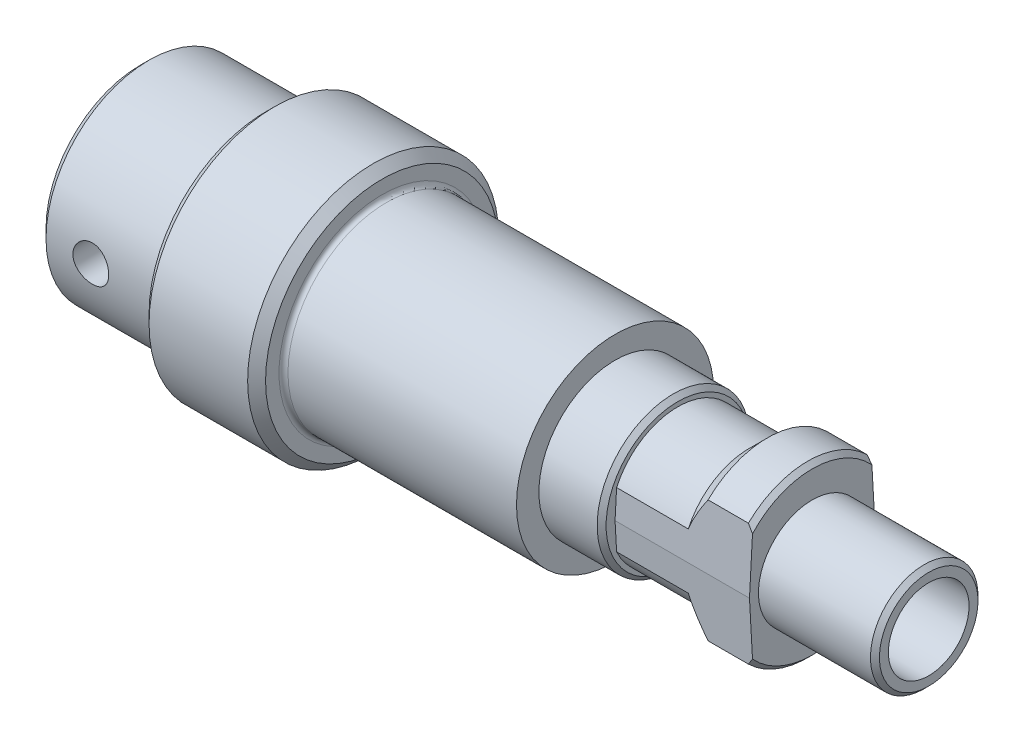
from build123d import *

# Parameters (mm, degrees)
CHANFREIN1_SIZE         = 1
CONG_1_R                = 0.5
CHANFREIN2_SIZE         = 0.5
ENL_V_MAT_EXTRU_1_DEPTH = 15
CHANFREIN3_SIZE         = 0.5
ESQUISSE3_R             = 2
ENL_V_MAT_EXTRU_2_DEPTH = 96.372952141


with BuildPart() as part:
    # Esquisse1 → Base-R_volution (revolve)
    with BuildSketch(Plane.XY, mode=Mode.PRIVATE) as base_r_volution_sk:
        Polygon((0, 4.5), (0, 6), (-13, 6), (-13, 9.5), (-18, 9.5), (-20, 7.5), (-28, 7.5), (-28, 8), (-28.5, 8.5), (-35, 8.5), (-35, 11), (-61, 11), (-61, 14), (-74, 14), (-74, 11.5), (-88, 11.5), (-88, 8.5), (-76, 8.5), (-76, 6), (-66, 6), (-66, 4.5), align=None)
    revolve(base_r_volution_sk.sketch.rotate(Axis((11, 0, 0), (-1, 0, 0)), 90), axis=Axis((11, 0, 0), (-1, 0, 0)))

    # Chanfrein1
    chanfrein1_edges = [part.edges().sort_by_distance(p)[0] for p in [
        (-61, 0, 14),
        (-74, 0, 14),
        (-88, 0, 11.5),
    ]]
    chamfer(chanfrein1_edges, length=CHANFREIN1_SIZE)

    # Cong_1
    cong_1_edges = [part.edges().sort_by_distance(p)[0] for p in [
        (-61, 0, 11),
    ]]
    fillet(cong_1_edges, radius=CONG_1_R)

    # Chanfrein2
    chanfrein2_edges = [part.edges().sort_by_distance(p)[0] for p in [
        (-88, 0, 8.5),
        (-76, 0, 6),
        (0, 0, 6),
        (-66, 0, 4.5),
    ]]
    chamfer(chanfrein2_edges, length=CHANFREIN2_SIZE)

    # Esquisse2 → Enl_v. mat.-Extru.1 (cut)
    with BuildSketch(Plane(origin=(-13, 0, 0), x_dir=(0, 0, -1), z_dir=(1, 0, 0))):
        Polygon((-7, 0), (-6.5, 9), (-14, 9), (-14, -9), (-6.5, -9), align=None)
        Polygon((14, -9), (6.5, -9), (7, 0), (6.5, 9), (14, 9), align=None)
    extrude(amount=-ENL_V_MAT_EXTRU_1_DEPTH, mode=Mode.SUBTRACT)

    # Chanfrein3
    chanfrein3_edges = [part.edges().sort_by_distance(p)[0] for p in [
        (-13, 9.5, 0),
        (-13, -9.5, 0),
    ]]
    chamfer(chanfrein3_edges, length=CHANFREIN3_SIZE)

    # Esquisse3 → Enl_v. mat.-Extru.2 (cut, through all)
    with BuildSketch(Plane.XY.offset(20)):
        with Locations((-82, 0)):
            Circle(ESQUISSE3_R)
    extrude(amount=-ENL_V_MAT_EXTRU_2_DEPTH, mode=Mode.SUBTRACT)


solid = part.part
